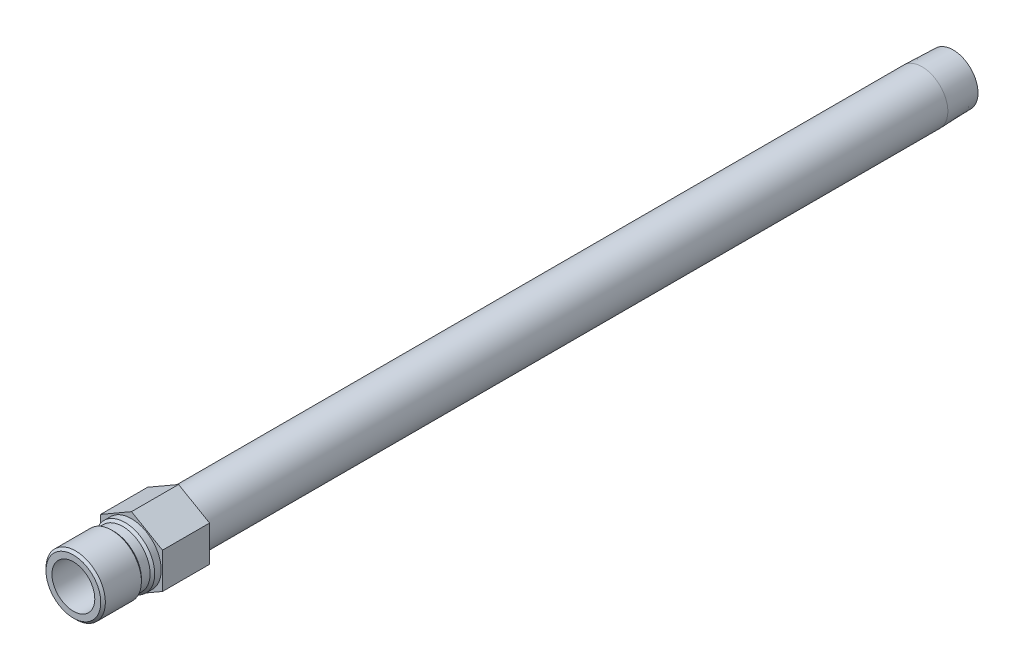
from build123d import *

# Parameters (mm, degrees)
SKETCH2_R           = 7.112
BOSS_EXTRUDE1_DEPTH = 15.621


with BuildPart() as part:
    # Sketch1 → Revolve1 (revolve)
    with BuildSketch(Plane(origin=(0, 0, 0), x_dir=(0, 0, -1), z_dir=(1, 0, 0))):
        Polygon((-19.304, 7.112), (-19.304, 9.0932), (-18.542, 9.8552), (-6.5786, 9.8552), (-5.8166, 9.0932), (-2.921, 9.0932), (-2.159, 9.8552), (0, 9.8552), (0, 8.5725), (262.4582, 8.5725), (272.796, 8.249445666), (272.796, 6.2611), (-1.071568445, 6.2611), (-1.524, 7.112), align=None)
    revolve(axis=Axis((0, 0, 0), (0, 0, 1)))

    # Sketch2 → Boss-Extrude1 (add)
    with BuildSketch(Plane.XY):
        Polygon((-10.287, 5.939202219), (-10.287, -5.939202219), (0, -11.878404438), (10.287, -5.939202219), (10.287, 5.939202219), (0, 11.878404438), align=None)
        with Locations(Location((0, 0, 0), (0, 0, 90))):
            Circle(SKETCH2_R, mode=Mode.SUBTRACT)
    extrude(amount=-BOSS_EXTRUDE1_DEPTH)


solid = part.part
